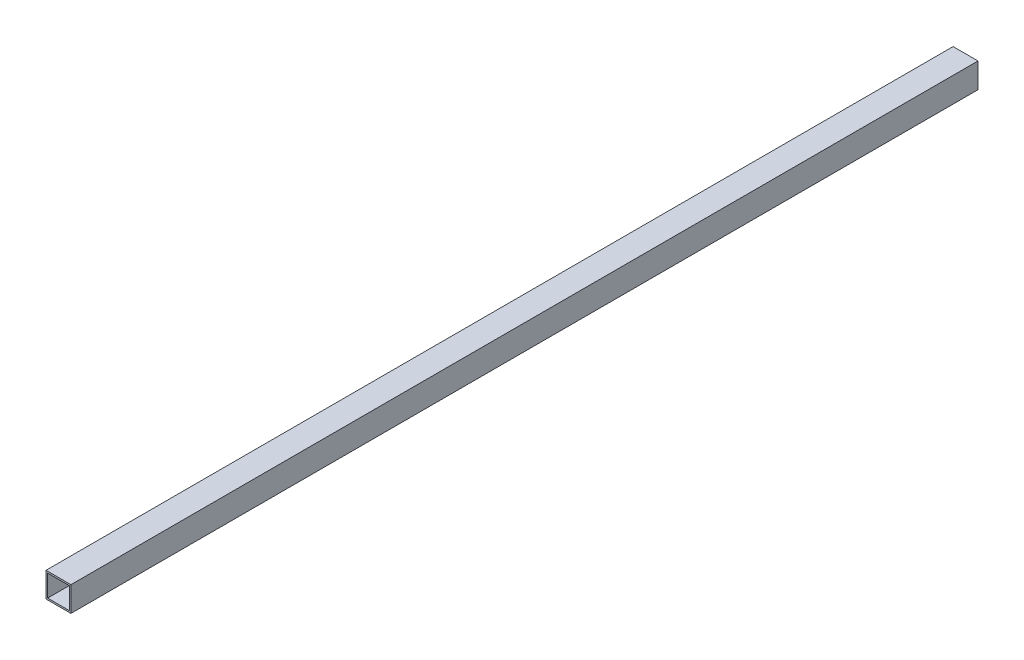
from build123d import *

# Parameters (mm, degrees)
ESQUISSE1_W        = 30
ESQUISSE1_H        = 30
ESQUISSE1_W_2      = 26
ESQUISSE1_H_2      = 26
EXTRU_MINCE1_DEPTH = 1092


with BuildPart() as part:
    # Esquisse1 → Extru.-Mince1 (new body)
    with BuildSketch(Plane.XY):
        Rectangle(ESQUISSE1_W, ESQUISSE1_H)
        Rectangle(ESQUISSE1_W_2, ESQUISSE1_H_2, mode=Mode.SUBTRACT)
    extrude(amount=EXTRU_MINCE1_DEPTH)


solid = part.part
